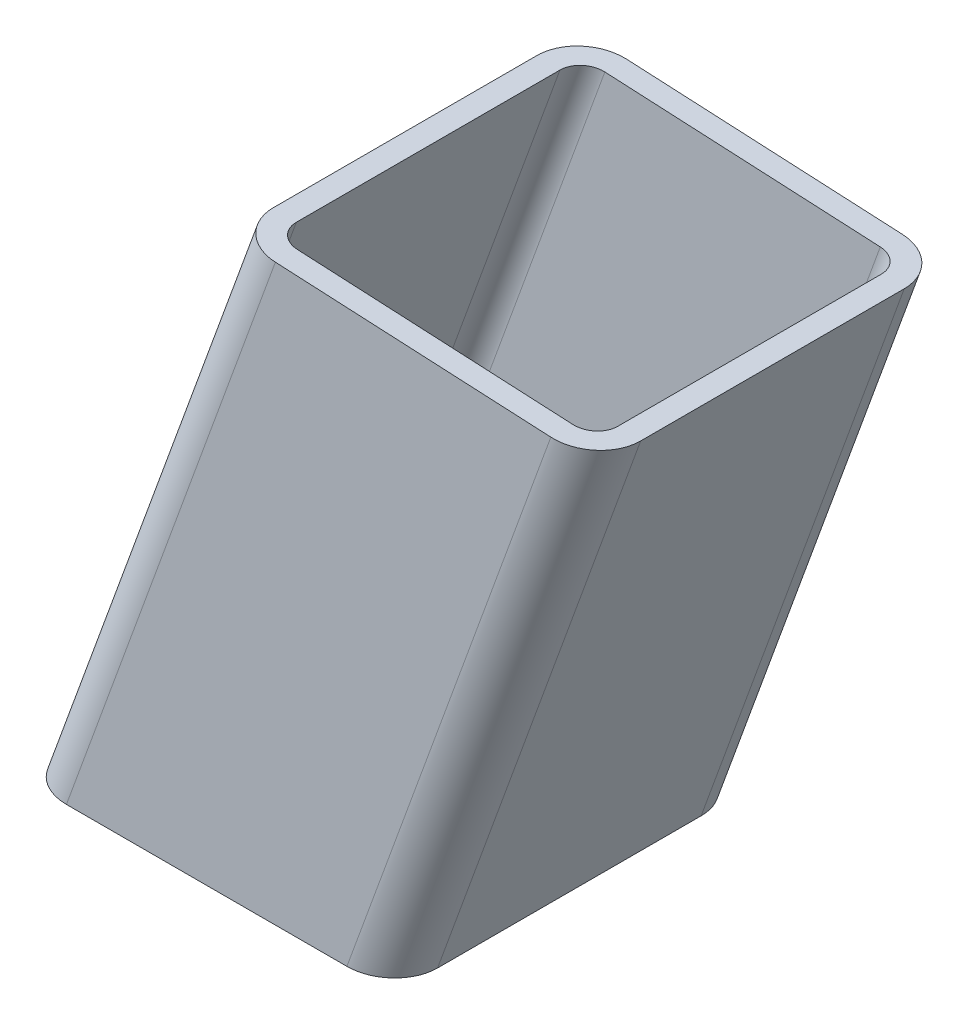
ISO-10303-21;
HEADER;
FILE_DESCRIPTION(('STEP AP214'),'2;1');
FILE_NAME('part.step','',(''),(''),'','','');
FILE_SCHEMA(('AUTOMOTIVE_DESIGN { 1 0 10303 214 1 1 1 1 }'));
ENDSEC;
DATA;
#1=APPLICATION_CONTEXT('core data for automotive mechanical design processes');
#2=APPLICATION_PROTOCOL_DEFINITION('international standard','automotive_design',2000,#1);
#3=PRODUCT_CONTEXT('',#1,'mechanical');
#4=PRODUCT('Part','Part','',(#3));
#5=PRODUCT_RELATED_PRODUCT_CATEGORY('part','',(#4));
#6=PRODUCT_DEFINITION_FORMATION('','',#4);
#7=PRODUCT_DEFINITION_CONTEXT('part definition',#1,'design');
#8=PRODUCT_DEFINITION('design','',#6,#7);
#9=PRODUCT_DEFINITION_SHAPE('','',#8);
#10=(LENGTH_UNIT() NAMED_UNIT(*) SI_UNIT(.MILLI.,.METRE.));
#11=(NAMED_UNIT(*) PLANE_ANGLE_UNIT() SI_UNIT($,.RADIAN.));
#12=(NAMED_UNIT(*) SI_UNIT($,.STERADIAN.) SOLID_ANGLE_UNIT());
#13=UNCERTAINTY_MEASURE_WITH_UNIT(LENGTH_MEASURE(1.E-05),#10,'distance_accuracy_value','');
#14=(GEOMETRIC_REPRESENTATION_CONTEXT(3) GLOBAL_UNCERTAINTY_ASSIGNED_CONTEXT((#13)) GLOBAL_UNIT_ASSIGNED_CONTEXT((#10,
#11,#12)) REPRESENTATION_CONTEXT('',''));
#15=CARTESIAN_POINT('',(0.,0.,0.));
#16=DIRECTION('',(0.,0.,1.));
#17=DIRECTION('',(1.,0.,0.));
#18=AXIS2_PLACEMENT_3D('',#15,#16,#17);
#19=CARTESIAN_POINT('',(3560.56947562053,248.977145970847,30.));
#20=DIRECTION('',(0.93969262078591,-0.342020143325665,0.));
#21=DIRECTION('',(0.342020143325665,0.93969262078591,0.));
#22=AXIS2_PLACEMENT_3D('',#19,#20,#21);
#23=PLANE('',#22);
#24=DIRECTION('',(0.,0.,-1.));
#25=VECTOR('',#24,1.);
#26=CARTESIAN_POINT('',(3490.69550882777,56.9999999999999,29.9999999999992));
#27=LINE('',#26,#25);
#28=CARTESIAN_POINT('',(3490.69550882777,57.,30.));
#29=VERTEX_POINT('',#28);
#30=CARTESIAN_POINT('',(3490.69550882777,57.0000000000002,-30.));
#31=VERTEX_POINT('',#30);
#32=EDGE_CURVE('E184',#29,#31,#27,.T.);
#33=ORIENTED_EDGE('',*,*,#32,.F.);
#34=DIRECTION('',(-0.342020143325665,-0.93969262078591,0.));
#35=VECTOR('',#34,1.);
#36=CARTESIAN_POINT('',(3560.56947562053,248.977145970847,30.));
#37=LINE('',#36,#35);
#38=CARTESIAN_POINT('',(3538.45670594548,188.222810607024,30.));
#39=VERTEX_POINT('',#38);
#40=EDGE_CURVE('E217',#39,#29,#37,.T.);
#41=ORIENTED_EDGE('',*,*,#40,.F.);
#42=DIRECTION('',(0.,0.,1.));
#43=VECTOR('',#42,1.);
#44=CARTESIAN_POINT('',(3538.45670594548,188.222810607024,30.));
#45=LINE('',#44,#43);
#46=CARTESIAN_POINT('',(3538.45670594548,188.222810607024,-30.));
#47=VERTEX_POINT('',#46);
#48=EDGE_CURVE('E227',#47,#39,#45,.T.);
#49=ORIENTED_EDGE('',*,*,#48,.F.);
#50=DIRECTION('',(-0.342020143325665,-0.93969262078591,0.));
#51=VECTOR('',#50,1.);
#52=CARTESIAN_POINT('',(3560.56947562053,248.977145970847,-30.));
#53=LINE('',#52,#51);
#54=EDGE_CURVE('E248',#47,#31,#53,.T.);
#55=ORIENTED_EDGE('',*,*,#54,.T.);
#56=EDGE_LOOP('',(#33,#41,#49,#55));
#57=FACE_BOUND('',#56,.T.);
#58=ADVANCED_FACE('F34',(#57),#23,.F.);
#59=CARTESIAN_POINT('',(3569.96640182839,245.55694453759,-30.));
#60=DIRECTION('',(-0.342020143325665,-0.93969262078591,0.));
#61=DIRECTION('',(0.93969262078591,-0.342020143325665,0.));
#62=AXIS2_PLACEMENT_3D('',#59,#60,#61);
#63=CYLINDRICAL_SURFACE('',#62,10.);
#64=CARTESIAN_POINT('',(3501.33728655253,57.0000000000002,-30.));
#65=DIRECTION('',(0.,-1.,0.));
#66=DIRECTION('',(-1.,0.,0.));
#67=AXIS2_PLACEMENT_3D('',#64,#65,#66);
#68=ELLIPSE('',#67,10.6417777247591,10.);
#69=CARTESIAN_POINT('',(3501.33728655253,57.0000000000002,-40.));
#70=VERTEX_POINT('',#69);
#71=EDGE_CURVE('E183',#31,#70,#68,.T.);
#72=ORIENTED_EDGE('',*,*,#71,.F.);
#73=ORIENTED_EDGE('',*,*,#54,.F.);
#74=CARTESIAN_POINT('',(3548.90802535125,187.699530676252,-30.));
#75=DIRECTION('',(0.0500056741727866,0.998748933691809,0.));
#76=DIRECTION('',(-0.998748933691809,0.0500056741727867,0.));
#77=AXIS2_PLACEMENT_3D('',#74,#75,#76);
#78=ELLIPSE('',#77,10.464411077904,10.);
#79=CARTESIAN_POINT('',(3548.90802535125,187.699530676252,-40.));
#80=VERTEX_POINT('',#79);
#81=EDGE_CURVE('E122',#80,#47,#78,.T.);
#82=ORIENTED_EDGE('',*,*,#81,.F.);
#83=DIRECTION('',(-0.342020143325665,-0.93969262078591,0.));
#84=VECTOR('',#83,1.);
#85=CARTESIAN_POINT('',(3569.96640182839,245.55694453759,-40.));
#86=LINE('',#85,#84);
#87=EDGE_CURVE('E245',#80,#70,#86,.T.);
#88=ORIENTED_EDGE('',*,*,#87,.T.);
#89=EDGE_LOOP('',(#72,#73,#82,#88));
#90=FACE_BOUND('',#89,.T.);
#91=ADVANCED_FACE('F308',(#90),#63,.T.);
#92=CARTESIAN_POINT('',(3626.34795907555,225.03573593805,-40.));
#93=DIRECTION('',(0.,0.,1.));
#94=DIRECTION('',(1.,0.,0.));
#95=AXIS2_PLACEMENT_3D('',#92,#93,#94);
#96=PLANE('',#95);
#97=DIRECTION('',(1.,0.,0.));
#98=VECTOR('',#97,1.);
#99=CARTESIAN_POINT('',(3626.34795907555,57.0000000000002,-40.));
#100=LINE('',#99,#98);
#101=CARTESIAN_POINT('',(3565.18795290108,57.0000000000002,-40.));
#102=VERTEX_POINT('',#101);
#103=EDGE_CURVE('E181',#70,#102,#100,.T.);
#104=ORIENTED_EDGE('',*,*,#103,.F.);
#105=ORIENTED_EDGE('',*,*,#87,.F.);
#106=DIRECTION('',(-0.998748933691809,0.0500056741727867,0.));
#107=VECTOR('',#106,1.);
#108=CARTESIAN_POINT('',(3624.28962895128,183.925300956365,-40.));
#109=LINE('',#108,#107);
#110=CARTESIAN_POINT('',(3611.61594178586,184.559851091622,-40.));
#111=VERTEX_POINT('',#110);
#112=EDGE_CURVE('E118',#111,#80,#109,.T.);
#113=ORIENTED_EDGE('',*,*,#112,.F.);
#114=DIRECTION('',(-0.342020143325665,-0.93969262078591,0.));
#115=VECTOR('',#114,1.);
#116=CARTESIAN_POINT('',(3626.34795907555,225.03573593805,-40.));
#117=LINE('',#116,#115);
#118=EDGE_CURVE('E242',#111,#102,#117,.T.);
#119=ORIENTED_EDGE('',*,*,#118,.T.);
#120=EDGE_LOOP('',(#104,#105,#113,#119));
#121=FACE_BOUND('',#120,.T.);
#122=ADVANCED_FACE('F306',(#121),#96,.F.);
#123=CARTESIAN_POINT('',(3626.34795907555,225.03573593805,-30.));
#124=DIRECTION('',(-0.342020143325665,-0.93969262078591,0.));
#125=DIRECTION('',(0.93969262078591,-0.342020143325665,0.));
#126=AXIS2_PLACEMENT_3D('',#123,#124,#125);
#127=CYLINDRICAL_SURFACE('',#126,10.);
#128=CARTESIAN_POINT('',(3565.18795290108,57.0000000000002,-30.));
#129=DIRECTION('',(0.,-1.,0.));
#130=DIRECTION('',(-1.,0.,0.));
#131=AXIS2_PLACEMENT_3D('',#128,#129,#130);
#132=ELLIPSE('',#131,10.6417777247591,10.);
#133=CARTESIAN_POINT('',(3575.82973062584,57.0000000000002,-30.));
#134=VERTEX_POINT('',#133);
#135=EDGE_CURVE('E179',#102,#134,#132,.T.);
#136=ORIENTED_EDGE('',*,*,#135,.F.);
#137=ORIENTED_EDGE('',*,*,#118,.F.);
#138=CARTESIAN_POINT('',(3611.61594178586,184.559851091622,-30.));
#139=DIRECTION('',(0.0500056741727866,0.998748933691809,0.));
#140=DIRECTION('',(-0.998748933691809,0.0500056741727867,0.));
#141=AXIS2_PLACEMENT_3D('',#138,#139,#140);
#142=ELLIPSE('',#141,10.4644110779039,10.);
#143=CARTESIAN_POINT('',(3622.06726119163,184.03657116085,-30.));
#144=VERTEX_POINT('',#143);
#145=EDGE_CURVE('E223',#144,#111,#142,.T.);
#146=ORIENTED_EDGE('',*,*,#145,.F.);
#147=DIRECTION('',(-0.342020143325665,-0.93969262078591,0.));
#148=VECTOR('',#147,1.);
#149=CARTESIAN_POINT('',(3635.74488528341,221.615534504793,-30.));
#150=LINE('',#149,#148);
#151=EDGE_CURVE('E239',#144,#134,#150,.T.);
#152=ORIENTED_EDGE('',*,*,#151,.T.);
#153=EDGE_LOOP('',(#136,#137,#146,#152));
#154=FACE_BOUND('',#153,.T.);
#155=ADVANCED_FACE('F301',(#154),#127,.T.);
#156=CARTESIAN_POINT('',(3635.74488528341,221.615534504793,-30.));
#157=DIRECTION('',(-0.93969262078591,0.342020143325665,0.));
#158=DIRECTION('',(-0.342020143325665,-0.93969262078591,0.));
#159=AXIS2_PLACEMENT_3D('',#156,#157,#158);
#160=PLANE('',#159);
#161=DIRECTION('',(0.,0.,1.));
#162=VECTOR('',#161,1.);
#163=CARTESIAN_POINT('',(3575.82973062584,57.0000000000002,-30.0000000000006));
#164=LINE('',#163,#162);
#165=CARTESIAN_POINT('',(3575.82973062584,56.9999999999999,30.));
#166=VERTEX_POINT('',#165);
#167=EDGE_CURVE('E173',#134,#166,#164,.T.);
#168=ORIENTED_EDGE('',*,*,#167,.F.);
#169=ORIENTED_EDGE('',*,*,#151,.F.);
#170=DIRECTION('',(0.,0.,-1.));
#171=VECTOR('',#170,1.);
#172=CARTESIAN_POINT('',(3622.06726119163,184.03657116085,-30.));
#173=LINE('',#172,#171);
#174=CARTESIAN_POINT('',(3622.06726119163,184.03657116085,30.));
#175=VERTEX_POINT('',#174);
#176=EDGE_CURVE('E221',#175,#144,#173,.T.);
#177=ORIENTED_EDGE('',*,*,#176,.F.);
#178=DIRECTION('',(-0.342020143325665,-0.93969262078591,0.));
#179=VECTOR('',#178,1.);
#180=CARTESIAN_POINT('',(3635.74488528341,221.615534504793,30.));
#181=LINE('',#180,#179);
#182=EDGE_CURVE('E236',#175,#166,#181,.T.);
#183=ORIENTED_EDGE('',*,*,#182,.T.);
#184=EDGE_LOOP('',(#168,#169,#177,#183));
#185=FACE_BOUND('',#184,.T.);
#186=ADVANCED_FACE('F298',(#185),#160,.F.);
#187=CARTESIAN_POINT('',(3626.34795907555,225.03573593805,30.));
#188=DIRECTION('',(-0.342020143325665,-0.93969262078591,0.));
#189=DIRECTION('',(0.93969262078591,-0.342020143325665,0.));
#190=AXIS2_PLACEMENT_3D('',#187,#188,#189);
#191=CYLINDRICAL_SURFACE('',#190,10.);
#192=CARTESIAN_POINT('',(3565.18795290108,56.9999999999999,30.));
#193=DIRECTION('',(0.,-1.,0.));
#194=DIRECTION('',(-1.,0.,0.));
#195=AXIS2_PLACEMENT_3D('',#192,#193,#194);
#196=ELLIPSE('',#195,10.6417777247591,10.);
#197=CARTESIAN_POINT('',(3565.18795290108,56.9999999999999,40.));
#198=VERTEX_POINT('',#197);
#199=EDGE_CURVE('E171',#166,#198,#196,.T.);
#200=ORIENTED_EDGE('',*,*,#199,.F.);
#201=ORIENTED_EDGE('',*,*,#182,.F.);
#202=CARTESIAN_POINT('',(3611.61594178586,184.559851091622,30.));
#203=DIRECTION('',(0.0500056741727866,0.998748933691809,0.));
#204=DIRECTION('',(-0.998748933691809,0.0500056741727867,0.));
#205=AXIS2_PLACEMENT_3D('',#202,#203,#204);
#206=ELLIPSE('',#205,10.464411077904,10.);
#207=CARTESIAN_POINT('',(3611.61594178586,184.559851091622,40.));
#208=VERTEX_POINT('',#207);
#209=EDGE_CURVE('E219',#208,#175,#206,.T.);
#210=ORIENTED_EDGE('',*,*,#209,.F.);
#211=DIRECTION('',(-0.342020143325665,-0.93969262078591,0.));
#212=VECTOR('',#211,1.);
#213=CARTESIAN_POINT('',(3626.34795907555,225.03573593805,40.));
#214=LINE('',#213,#212);
#215=EDGE_CURVE('E233',#208,#198,#214,.T.);
#216=ORIENTED_EDGE('',*,*,#215,.T.);
#217=EDGE_LOOP('',(#200,#201,#210,#216));
#218=FACE_BOUND('',#217,.T.);
#219=ADVANCED_FACE('F291',(#218),#191,.T.);
#220=CARTESIAN_POINT('',(3569.96640182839,245.55694453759,40.));
#221=DIRECTION('',(0.,0.,-1.));
#222=DIRECTION('',(-1.,0.,0.));
#223=AXIS2_PLACEMENT_3D('',#220,#221,#222);
#224=PLANE('',#223);
#225=DIRECTION('',(-1.,0.,0.));
#226=VECTOR('',#225,1.);
#227=CARTESIAN_POINT('',(3569.96640182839,56.9999999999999,40.));
#228=LINE('',#227,#226);
#229=CARTESIAN_POINT('',(3501.33728655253,56.9999999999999,40.));
#230=VERTEX_POINT('',#229);
#231=EDGE_CURVE('E53',#198,#230,#228,.T.);
#232=ORIENTED_EDGE('',*,*,#231,.F.);
#233=ORIENTED_EDGE('',*,*,#215,.F.);
#234=DIRECTION('',(0.998748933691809,-0.0500056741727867,0.));
#235=VECTOR('',#234,1.);
#236=CARTESIAN_POINT('',(3567.02416453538,186.792486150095,40.));
#237=LINE('',#236,#235);
#238=CARTESIAN_POINT('',(3548.90802535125,187.699530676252,40.));
#239=VERTEX_POINT('',#238);
#240=EDGE_CURVE('E216',#239,#208,#237,.T.);
#241=ORIENTED_EDGE('',*,*,#240,.F.);
#242=DIRECTION('',(-0.342020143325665,-0.93969262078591,0.));
#243=VECTOR('',#242,1.);
#244=CARTESIAN_POINT('',(3569.96640182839,245.55694453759,40.));
#245=LINE('',#244,#243);
#246=EDGE_CURVE('E230',#239,#230,#245,.T.);
#247=ORIENTED_EDGE('',*,*,#246,.T.);
#248=EDGE_LOOP('',(#232,#233,#241,#247));
#249=FACE_BOUND('',#248,.T.);
#250=ADVANCED_FACE('F288',(#249),#224,.F.);
#251=CARTESIAN_POINT('',(3569.96640182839,245.55694453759,30.));
#252=DIRECTION('',(-0.342020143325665,-0.93969262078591,0.));
#253=DIRECTION('',(0.93969262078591,-0.342020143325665,0.));
#254=AXIS2_PLACEMENT_3D('',#251,#252,#253);
#255=CYLINDRICAL_SURFACE('',#254,10.);
#256=CARTESIAN_POINT('',(3501.33728655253,56.9999999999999,30.));
#257=DIRECTION('',(0.,-1.,0.));
#258=DIRECTION('',(-1.,0.,0.));
#259=AXIS2_PLACEMENT_3D('',#256,#257,#258);
#260=ELLIPSE('',#259,10.6417777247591,10.);
#261=EDGE_CURVE('E176',#230,#29,#260,.T.);
#262=ORIENTED_EDGE('',*,*,#261,.F.);
#263=ORIENTED_EDGE('',*,*,#246,.F.);
#264=CARTESIAN_POINT('',(3548.90802535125,187.699530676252,30.));
#265=DIRECTION('',(0.0500056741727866,0.998748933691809,0.));
#266=DIRECTION('',(-0.998748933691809,0.0500056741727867,0.));
#267=AXIS2_PLACEMENT_3D('',#264,#265,#266);
#268=ELLIPSE('',#267,10.464411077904,10.);
#269=EDGE_CURVE('E214',#39,#239,#268,.T.);
#270=ORIENTED_EDGE('',*,*,#269,.F.);
#271=ORIENTED_EDGE('',*,*,#40,.T.);
#272=EDGE_LOOP('',(#262,#263,#270,#271));
#273=FACE_BOUND('',#272,.T.);
#274=ADVANCED_FACE('F36',(#273),#255,.T.);
#275=CARTESIAN_POINT('',(6158.08276398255,57.0625533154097,-40.));
#276=DIRECTION('',(0.0500056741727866,0.998748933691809,0.));
#277=DIRECTION('',(-0.998748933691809,0.0500056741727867,0.));
#278=AXIS2_PLACEMENT_3D('',#275,#276,#277);
#279=PLANE('',#278);
#280=DIRECTION('',(0.998748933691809,-0.0500056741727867,0.));
#281=VECTOR('',#280,1.);
#282=CARTESIAN_POINT('',(3567.02416453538,186.792486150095,35.));
#283=LINE('',#282,#281);
#284=CARTESIAN_POINT('',(3548.90802535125,187.699530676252,35.));
#285=VERTEX_POINT('',#284);
#286=CARTESIAN_POINT('',(3611.61594178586,184.559851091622,35.));
#287=VERTEX_POINT('',#286);
#288=EDGE_CURVE('E186',#285,#287,#283,.T.);
#289=ORIENTED_EDGE('',*,*,#288,.F.);
#290=CARTESIAN_POINT('',(3548.90802535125,187.699530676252,30.));
#291=DIRECTION('',(0.0500056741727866,0.998748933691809,0.));
#292=DIRECTION('',(-0.998748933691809,0.0500056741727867,0.));
#293=AXIS2_PLACEMENT_3D('',#290,#291,#292);
#294=ELLIPSE('',#293,5.23220553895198,5.00000000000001);
#295=CARTESIAN_POINT('',(3543.68236564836,187.961170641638,30.));
#296=VERTEX_POINT('',#295);
#297=EDGE_CURVE('E191',#296,#285,#294,.T.);
#298=ORIENTED_EDGE('',*,*,#297,.F.);
#299=DIRECTION('',(0.,0.,1.));
#300=VECTOR('',#299,1.);
#301=CARTESIAN_POINT('',(3543.68236564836,187.961170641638,30.));
#302=LINE('',#301,#300);
#303=CARTESIAN_POINT('',(3543.68236564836,187.961170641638,-30.));
#304=VERTEX_POINT('',#303);
#305=EDGE_CURVE('E196',#304,#296,#302,.T.);
#306=ORIENTED_EDGE('',*,*,#305,.F.);
#307=CARTESIAN_POINT('',(3548.90802535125,187.699530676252,-30.));
#308=DIRECTION('',(0.0500056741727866,0.998748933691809,0.));
#309=DIRECTION('',(-0.998748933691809,0.0500056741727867,0.));
#310=AXIS2_PLACEMENT_3D('',#307,#308,#309);
#311=ELLIPSE('',#310,5.23220553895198,5.00000000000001);
#312=CARTESIAN_POINT('',(3548.90802535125,187.699530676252,-35.));
#313=VERTEX_POINT('',#312);
#314=EDGE_CURVE('E201',#313,#304,#311,.T.);
#315=ORIENTED_EDGE('',*,*,#314,.F.);
#316=DIRECTION('',(-0.998748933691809,0.0500056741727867,0.));
#317=VECTOR('',#316,1.);
#318=CARTESIAN_POINT('',(3624.28962895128,183.925300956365,-35.));
#319=LINE('',#318,#317);
#320=CARTESIAN_POINT('',(3611.61594178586,184.559851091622,-35.));
#321=VERTEX_POINT('',#320);
#322=EDGE_CURVE('E206',#321,#313,#319,.T.);
#323=ORIENTED_EDGE('',*,*,#322,.F.);
#324=CARTESIAN_POINT('',(3611.61594178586,184.559851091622,-30.));
#325=DIRECTION('',(0.0500056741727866,0.998748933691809,0.));
#326=DIRECTION('',(-0.998748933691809,0.0500056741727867,0.));
#327=AXIS2_PLACEMENT_3D('',#324,#325,#326);
#328=ELLIPSE('',#327,5.23220553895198,5.00000000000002);
#329=CARTESIAN_POINT('',(3616.84160148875,184.298211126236,-30.));
#330=VERTEX_POINT('',#329);
#331=EDGE_CURVE('E167',#330,#321,#328,.T.);
#332=ORIENTED_EDGE('',*,*,#331,.F.);
#333=DIRECTION('',(0.,0.,-1.));
#334=VECTOR('',#333,1.);
#335=CARTESIAN_POINT('',(3616.84160148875,184.298211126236,-30.));
#336=LINE('',#335,#334);
#337=CARTESIAN_POINT('',(3616.84160148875,184.298211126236,30.));
#338=VERTEX_POINT('',#337);
#339=EDGE_CURVE('E158',#338,#330,#336,.T.);
#340=ORIENTED_EDGE('',*,*,#339,.F.);
#341=CARTESIAN_POINT('',(3611.61594178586,184.559851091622,30.));
#342=DIRECTION('',(0.0500056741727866,0.998748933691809,0.));
#343=DIRECTION('',(-0.998748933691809,0.0500056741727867,0.));
#344=AXIS2_PLACEMENT_3D('',#341,#342,#343);
#345=ELLIPSE('',#344,5.23220553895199,5.00000000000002);
#346=EDGE_CURVE('E11',#287,#338,#345,.T.);
#347=ORIENTED_EDGE('',*,*,#346,.F.);
#348=EDGE_LOOP('',(#289,#298,#306,#315,#323,#332,#340,#347));
#349=FACE_BOUND('',#348,.T.);
#350=ORIENTED_EDGE('',*,*,#269,.T.);
#351=ORIENTED_EDGE('',*,*,#240,.T.);
#352=ORIENTED_EDGE('',*,*,#209,.T.);
#353=ORIENTED_EDGE('',*,*,#176,.T.);
#354=ORIENTED_EDGE('',*,*,#145,.T.);
#355=ORIENTED_EDGE('',*,*,#112,.T.);
#356=ORIENTED_EDGE('',*,*,#81,.T.);
#357=ORIENTED_EDGE('',*,*,#48,.T.);
#358=EDGE_LOOP('',(#350,#351,#352,#353,#354,#355,#356,#357));
#359=FACE_BOUND('',#358,.T.);
#360=ADVANCED_FACE('F284',(#349,#359),#279,.T.);
#361=CARTESIAN_POINT('',(9149.96897120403,57.0000000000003,-59.9999999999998));
#362=DIRECTION('',(0.,-1.,0.));
#363=DIRECTION('',(0.,0.,-1.));
#364=AXIS2_PLACEMENT_3D('',#361,#362,#363);
#365=PLANE('',#364);
#366=DIRECTION('',(0.,0.,1.));
#367=VECTOR('',#366,1.);
#368=CARTESIAN_POINT('',(3570.50884176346,57.0000000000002,-30.0000000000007));
#369=LINE('',#368,#367);
#370=CARTESIAN_POINT('',(3570.50884176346,57.0000000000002,-30.));
#371=VERTEX_POINT('',#370);
#372=CARTESIAN_POINT('',(3570.50884176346,57.,30.));
#373=VERTEX_POINT('',#372);
#374=EDGE_CURVE('E151',#371,#373,#369,.T.);
#375=ORIENTED_EDGE('',*,*,#374,.F.);
#376=CARTESIAN_POINT('',(3565.18795290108,57.0000000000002,-30.));
#377=DIRECTION('',(0.,-1.,0.));
#378=DIRECTION('',(-1.,0.,0.));
#379=AXIS2_PLACEMENT_3D('',#376,#377,#378);
#380=ELLIPSE('',#379,5.32088886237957,5.00000000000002);
#381=CARTESIAN_POINT('',(3565.18795290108,57.0000000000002,-35.));
#382=VERTEX_POINT('',#381);
#383=EDGE_CURVE('E147',#382,#371,#380,.T.);
#384=ORIENTED_EDGE('',*,*,#383,.F.);
#385=DIRECTION('',(1.,0.,0.));
#386=VECTOR('',#385,1.);
#387=CARTESIAN_POINT('',(3626.34795907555,57.0000000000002,-35.));
#388=LINE('',#387,#386);
#389=CARTESIAN_POINT('',(3501.33728655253,57.0000000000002,-35.));
#390=VERTEX_POINT('',#389);
#391=EDGE_CURVE('E210',#390,#382,#388,.T.);
#392=ORIENTED_EDGE('',*,*,#391,.F.);
#393=CARTESIAN_POINT('',(3501.33728655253,57.0000000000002,-30.));
#394=DIRECTION('',(0.,-1.,0.));
#395=DIRECTION('',(-1.,0.,0.));
#396=AXIS2_PLACEMENT_3D('',#393,#394,#395);
#397=ELLIPSE('',#396,5.32088886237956,5.00000000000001);
#398=CARTESIAN_POINT('',(3496.01639769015,57.0000000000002,-30.));
#399=VERTEX_POINT('',#398);
#400=EDGE_CURVE('E205',#399,#390,#397,.T.);
#401=ORIENTED_EDGE('',*,*,#400,.F.);
#402=DIRECTION('',(0.,0.,-1.));
#403=VECTOR('',#402,1.);
#404=CARTESIAN_POINT('',(3496.01639769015,56.9999999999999,29.9999999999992));
#405=LINE('',#404,#403);
#406=CARTESIAN_POINT('',(3496.01639769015,56.9999999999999,30.));
#407=VERTEX_POINT('',#406);
#408=EDGE_CURVE('E200',#407,#399,#405,.T.);
#409=ORIENTED_EDGE('',*,*,#408,.F.);
#410=CARTESIAN_POINT('',(3501.33728655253,56.9999999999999,30.));
#411=DIRECTION('',(0.,-1.,0.));
#412=DIRECTION('',(-1.,0.,0.));
#413=AXIS2_PLACEMENT_3D('',#410,#411,#412);
#414=ELLIPSE('',#413,5.32088886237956,5.00000000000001);
#415=CARTESIAN_POINT('',(3501.33728655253,56.9999999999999,35.));
#416=VERTEX_POINT('',#415);
#417=EDGE_CURVE('E195',#416,#407,#414,.T.);
#418=ORIENTED_EDGE('',*,*,#417,.F.);
#419=DIRECTION('',(-1.,0.,0.));
#420=VECTOR('',#419,1.);
#421=CARTESIAN_POINT('',(3569.96640182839,56.9999999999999,35.));
#422=LINE('',#421,#420);
#423=CARTESIAN_POINT('',(3565.18795290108,56.9999999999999,35.));
#424=VERTEX_POINT('',#423);
#425=EDGE_CURVE('E190',#424,#416,#422,.T.);
#426=ORIENTED_EDGE('',*,*,#425,.F.);
#427=CARTESIAN_POINT('',(3565.18795290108,56.9999999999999,30.));
#428=DIRECTION('',(0.,-1.,0.));
#429=DIRECTION('',(-1.,0.,0.));
#430=AXIS2_PLACEMENT_3D('',#427,#428,#429);
#431=ELLIPSE('',#430,5.32088886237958,5.00000000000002);
#432=EDGE_CURVE('E44',#373,#424,#431,.T.);
#433=ORIENTED_EDGE('',*,*,#432,.F.);
#434=EDGE_LOOP('',(#375,#384,#392,#401,#409,#418,#426,#433));
#435=FACE_BOUND('',#434,.T.);
#436=ORIENTED_EDGE('',*,*,#261,.T.);
#437=ORIENTED_EDGE('',*,*,#32,.T.);
#438=ORIENTED_EDGE('',*,*,#71,.T.);
#439=ORIENTED_EDGE('',*,*,#103,.T.);
#440=ORIENTED_EDGE('',*,*,#135,.T.);
#441=ORIENTED_EDGE('',*,*,#167,.T.);
#442=ORIENTED_EDGE('',*,*,#199,.T.);
#443=ORIENTED_EDGE('',*,*,#231,.T.);
#444=EDGE_LOOP('',(#436,#437,#438,#439,#440,#441,#442,#443));
#445=FACE_BOUND('',#444,.T.);
#446=ADVANCED_FACE('F152',(#435,#445),#365,.T.);
#447=CARTESIAN_POINT('',(3631.04642217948,223.325635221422,-30.));
#448=DIRECTION('',(-0.93969262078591,0.342020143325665,0.));
#449=DIRECTION('',(-0.342020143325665,-0.93969262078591,0.));
#450=AXIS2_PLACEMENT_3D('',#447,#448,#449);
#451=PLANE('',#450);
#452=DIRECTION('',(-0.342020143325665,-0.93969262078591,0.));
#453=VECTOR('',#452,1.);
#454=CARTESIAN_POINT('',(3631.04642217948,223.325635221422,-30.));
#455=LINE('',#454,#453);
#456=EDGE_CURVE('E38',#330,#371,#455,.T.);
#457=ORIENTED_EDGE('',*,*,#456,.T.);
#458=ORIENTED_EDGE('',*,*,#374,.T.);
#459=DIRECTION('',(-0.342020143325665,-0.93969262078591,0.));
#460=VECTOR('',#459,1.);
#461=CARTESIAN_POINT('',(3631.04642217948,223.325635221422,30.));
#462=LINE('',#461,#460);
#463=EDGE_CURVE('E189',#338,#373,#462,.T.);
#464=ORIENTED_EDGE('',*,*,#463,.F.);
#465=ORIENTED_EDGE('',*,*,#339,.T.);
#466=EDGE_LOOP('',(#457,#458,#464,#465));
#467=FACE_BOUND('',#466,.T.);
#468=ADVANCED_FACE('F170',(#467),#451,.T.);
#469=CARTESIAN_POINT('',(3626.34795907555,225.03573593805,-30.));
#470=DIRECTION('',(-0.342020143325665,-0.93969262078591,0.));
#471=DIRECTION('',(0.93969262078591,-0.342020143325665,0.));
#472=AXIS2_PLACEMENT_3D('',#469,#470,#471);
#473=CYLINDRICAL_SURFACE('',#472,5.00000000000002);
#474=DIRECTION('',(-0.342020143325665,-0.93969262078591,0.));
#475=VECTOR('',#474,1.);
#476=CARTESIAN_POINT('',(3626.34795907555,225.03573593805,-35.));
#477=LINE('',#476,#475);
#478=EDGE_CURVE('E166',#321,#382,#477,.T.);
#479=ORIENTED_EDGE('',*,*,#478,.T.);
#480=ORIENTED_EDGE('',*,*,#383,.T.);
#481=ORIENTED_EDGE('',*,*,#456,.F.);
#482=ORIENTED_EDGE('',*,*,#331,.T.);
#483=EDGE_LOOP('',(#479,#480,#481,#482));
#484=FACE_BOUND('',#483,.T.);
#485=ADVANCED_FACE('F163',(#484),#473,.F.);
#486=CARTESIAN_POINT('',(3626.34795907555,225.03573593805,-35.));
#487=DIRECTION('',(0.,0.,1.));
#488=DIRECTION('',(1.,0.,0.));
#489=AXIS2_PLACEMENT_3D('',#486,#487,#488);
#490=PLANE('',#489);
#491=DIRECTION('',(-0.342020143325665,-0.93969262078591,0.));
#492=VECTOR('',#491,1.);
#493=CARTESIAN_POINT('',(3569.96640182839,245.55694453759,-35.));
#494=LINE('',#493,#492);
#495=EDGE_CURVE('E212',#313,#390,#494,.T.);
#496=ORIENTED_EDGE('',*,*,#495,.T.);
#497=ORIENTED_EDGE('',*,*,#391,.T.);
#498=ORIENTED_EDGE('',*,*,#478,.F.);
#499=ORIENTED_EDGE('',*,*,#322,.T.);
#500=EDGE_LOOP('',(#496,#497,#498,#499));
#501=FACE_BOUND('',#500,.T.);
#502=ADVANCED_FACE('F342',(#501),#490,.T.);
#503=CARTESIAN_POINT('',(3569.96640182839,245.55694453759,-30.));
#504=DIRECTION('',(-0.342020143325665,-0.93969262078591,0.));
#505=DIRECTION('',(0.93969262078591,-0.342020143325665,0.));
#506=AXIS2_PLACEMENT_3D('',#503,#504,#505);
#507=CYLINDRICAL_SURFACE('',#506,5.00000000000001);
#508=DIRECTION('',(-0.342020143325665,-0.93969262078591,0.));
#509=VECTOR('',#508,1.);
#510=CARTESIAN_POINT('',(3565.26793872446,247.267045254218,-30.));
#511=LINE('',#510,#509);
#512=EDGE_CURVE('E209',#304,#399,#511,.T.);
#513=ORIENTED_EDGE('',*,*,#512,.T.);
#514=ORIENTED_EDGE('',*,*,#400,.T.);
#515=ORIENTED_EDGE('',*,*,#495,.F.);
#516=ORIENTED_EDGE('',*,*,#314,.T.);
#517=EDGE_LOOP('',(#513,#514,#515,#516));
#518=FACE_BOUND('',#517,.T.);
#519=ADVANCED_FACE('F345',(#518),#507,.F.);
#520=CARTESIAN_POINT('',(3565.26793872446,247.267045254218,30.));
#521=DIRECTION('',(0.93969262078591,-0.342020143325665,0.));
#522=DIRECTION('',(0.342020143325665,0.93969262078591,0.));
#523=AXIS2_PLACEMENT_3D('',#520,#521,#522);
#524=PLANE('',#523);
#525=DIRECTION('',(-0.342020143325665,-0.93969262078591,0.));
#526=VECTOR('',#525,1.);
#527=CARTESIAN_POINT('',(3565.26793872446,247.267045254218,30.));
#528=LINE('',#527,#526);
#529=EDGE_CURVE('E204',#296,#407,#528,.T.);
#530=ORIENTED_EDGE('',*,*,#529,.T.);
#531=ORIENTED_EDGE('',*,*,#408,.T.);
#532=ORIENTED_EDGE('',*,*,#512,.F.);
#533=ORIENTED_EDGE('',*,*,#305,.T.);
#534=EDGE_LOOP('',(#530,#531,#532,#533));
#535=FACE_BOUND('',#534,.T.);
#536=ADVANCED_FACE('F348',(#535),#524,.T.);
#537=CARTESIAN_POINT('',(3569.96640182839,245.55694453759,30.));
#538=DIRECTION('',(-0.342020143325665,-0.93969262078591,0.));
#539=DIRECTION('',(0.93969262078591,-0.342020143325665,0.));
#540=AXIS2_PLACEMENT_3D('',#537,#538,#539);
#541=CYLINDRICAL_SURFACE('',#540,5.00000000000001);
#542=DIRECTION('',(-0.342020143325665,-0.93969262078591,0.));
#543=VECTOR('',#542,1.);
#544=CARTESIAN_POINT('',(3569.96640182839,245.55694453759,35.));
#545=LINE('',#544,#543);
#546=EDGE_CURVE('E199',#285,#416,#545,.T.);
#547=ORIENTED_EDGE('',*,*,#546,.T.);
#548=ORIENTED_EDGE('',*,*,#417,.T.);
#549=ORIENTED_EDGE('',*,*,#529,.F.);
#550=ORIENTED_EDGE('',*,*,#297,.T.);
#551=EDGE_LOOP('',(#547,#548,#549,#550));
#552=FACE_BOUND('',#551,.T.);
#553=ADVANCED_FACE('F352',(#552),#541,.F.);
#554=CARTESIAN_POINT('',(3569.96640182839,245.55694453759,35.));
#555=DIRECTION('',(0.,0.,-1.));
#556=DIRECTION('',(-1.,0.,0.));
#557=AXIS2_PLACEMENT_3D('',#554,#555,#556);
#558=PLANE('',#557);
#559=DIRECTION('',(-0.342020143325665,-0.93969262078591,0.));
#560=VECTOR('',#559,1.);
#561=CARTESIAN_POINT('',(3626.34795907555,225.03573593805,35.));
#562=LINE('',#561,#560);
#563=EDGE_CURVE('E194',#287,#424,#562,.T.);
#564=ORIENTED_EDGE('',*,*,#563,.T.);
#565=ORIENTED_EDGE('',*,*,#425,.T.);
#566=ORIENTED_EDGE('',*,*,#546,.F.);
#567=ORIENTED_EDGE('',*,*,#288,.T.);
#568=EDGE_LOOP('',(#564,#565,#566,#567));
#569=FACE_BOUND('',#568,.T.);
#570=ADVANCED_FACE('F356',(#569),#558,.T.);
#571=CARTESIAN_POINT('',(3626.34795907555,225.03573593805,30.));
#572=DIRECTION('',(-0.342020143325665,-0.93969262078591,0.));
#573=DIRECTION('',(0.93969262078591,-0.342020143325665,0.));
#574=AXIS2_PLACEMENT_3D('',#571,#572,#573);
#575=CYLINDRICAL_SURFACE('',#574,5.00000000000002);
#576=ORIENTED_EDGE('',*,*,#463,.T.);
#577=ORIENTED_EDGE('',*,*,#432,.T.);
#578=ORIENTED_EDGE('',*,*,#563,.F.);
#579=ORIENTED_EDGE('',*,*,#346,.T.);
#580=EDGE_LOOP('',(#576,#577,#578,#579));
#581=FACE_BOUND('',#580,.T.);
#582=ADVANCED_FACE('F359',(#581),#575,.F.);
#583=CLOSED_SHELL('',(#58,#91,#122,#155,#186,#219,#250,#274,#360,#446,#468,#485,#502,#519,#536,
#553,#570,#582));
#584=MANIFOLD_SOLID_BREP('B2',#583);
#585=ADVANCED_BREP_SHAPE_REPRESENTATION('',(#18,#584),#14);
#586=SHAPE_DEFINITION_REPRESENTATION(#9,#585);
ENDSEC;
END-ISO-10303-21;
